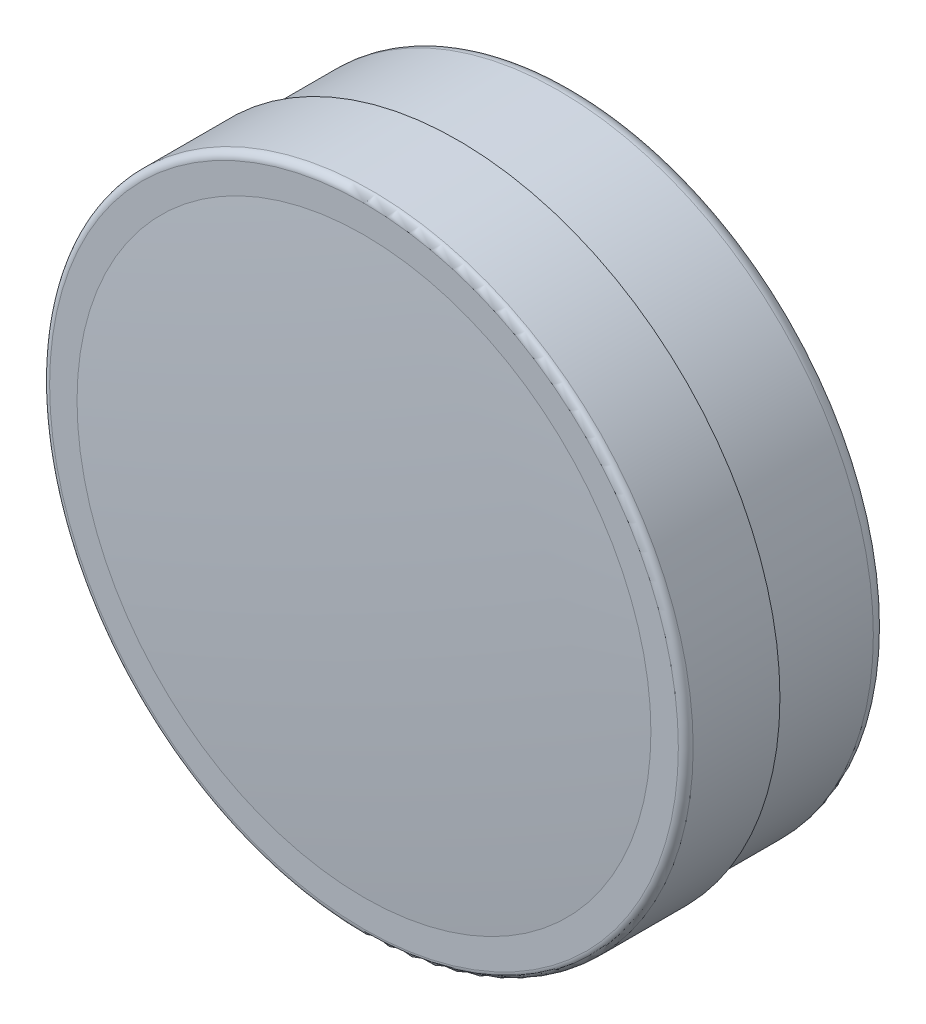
ISO-10303-21;
HEADER;
FILE_DESCRIPTION(('STEP AP214'),'2;1');
FILE_NAME('part.step','',(''),(''),'','','');
FILE_SCHEMA(('AUTOMOTIVE_DESIGN { 1 0 10303 214 1 1 1 1 }'));
ENDSEC;
DATA;
#1=APPLICATION_CONTEXT('core data for automotive mechanical design processes');
#2=APPLICATION_PROTOCOL_DEFINITION('international standard','automotive_design',2000,#1);
#3=PRODUCT_CONTEXT('',#1,'mechanical');
#4=PRODUCT('Part','Part','',(#3));
#5=PRODUCT_RELATED_PRODUCT_CATEGORY('part','',(#4));
#6=PRODUCT_DEFINITION_FORMATION('','',#4);
#7=PRODUCT_DEFINITION_CONTEXT('part definition',#1,'design');
#8=PRODUCT_DEFINITION('design','',#6,#7);
#9=PRODUCT_DEFINITION_SHAPE('','',#8);
#10=(LENGTH_UNIT() NAMED_UNIT(*) SI_UNIT(.MILLI.,.METRE.));
#11=(NAMED_UNIT(*) PLANE_ANGLE_UNIT() SI_UNIT($,.RADIAN.));
#12=(NAMED_UNIT(*) SI_UNIT($,.STERADIAN.) SOLID_ANGLE_UNIT());
#13=UNCERTAINTY_MEASURE_WITH_UNIT(LENGTH_MEASURE(1.E-05),#10,'distance_accuracy_value','');
#14=(GEOMETRIC_REPRESENTATION_CONTEXT(3) GLOBAL_UNCERTAINTY_ASSIGNED_CONTEXT((#13)) GLOBAL_UNIT_ASSIGNED_CONTEXT((#10,
#11,#12)) REPRESENTATION_CONTEXT('',''));
#15=CARTESIAN_POINT('',(0.,0.,0.));
#16=DIRECTION('',(0.,0.,1.));
#17=DIRECTION('',(1.,0.,0.));
#18=AXIS2_PLACEMENT_3D('',#15,#16,#17);
#19=CARTESIAN_POINT('',(-3.,1.73205080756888,-4.2));
#20=DIRECTION('',(0.5,-0.866025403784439,0.));
#21=DIRECTION('',(0.866025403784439,0.5,0.));
#22=AXIS2_PLACEMENT_3D('',#19,#20,#21);
#23=PLANE('',#22);
#24=CARTESIAN_POINT('',(-3.0002,1.73193533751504,-3.93198413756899));
#25=CARTESIAN_POINT('',(-2.86836479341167,1.80805042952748,-3.9759462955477));
#26=CARTESIAN_POINT('',(-2.73539159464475,1.88482254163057,-4.01592841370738));
#27=CARTESIAN_POINT('',(-2.46714257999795,2.03969618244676,-4.08571791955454));
#28=CARTESIAN_POINT('',(-2.33186199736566,2.11780046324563,-4.11550061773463));
#29=CARTESIAN_POINT('',(-2.06297739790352,2.27304105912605,-4.16186216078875));
#30=CARTESIAN_POINT('',(-1.92941475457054,2.35015348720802,-4.17874955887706));
#31=CARTESIAN_POINT('',(-1.66166094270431,2.50474122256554,-4.19891035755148));
#32=CARTESIAN_POINT('',(-1.52747074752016,2.58221596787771,-4.20220045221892));
#33=CARTESIAN_POINT('',(-1.27672440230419,2.72698443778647,-4.19535946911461));
#34=CARTESIAN_POINT('',(-1.16013073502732,2.79429982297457,-4.18690808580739));
#35=CARTESIAN_POINT('',(-0.927703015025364,2.92849202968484,-4.16012105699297));
#36=CARTESIAN_POINT('',(-0.811869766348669,2.99536838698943,-4.1417762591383));
#37=CARTESIAN_POINT('',(-0.578962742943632,3.12983731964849,-4.09591524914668));
#38=CARTESIAN_POINT('',(-0.461918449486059,3.19741287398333,-4.06820461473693));
#39=CARTESIAN_POINT('',(-0.229575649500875,3.33155605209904,-4.00531220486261));
#40=CARTESIAN_POINT('',(-0.114274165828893,3.39812539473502,-3.97014520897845));
#41=CARTESIAN_POINT('',(0.000199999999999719,3.4642170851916,-3.93198413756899));
#42=B_SPLINE_CURVE_WITH_KNOTS('',3,(#24,#25,#26,#27,#28,#29,#30,#31,#32,#33,#34,#35,#36,#37,#38,
#39,#40,#41),.UNSPECIFIED.,.F.,.F.,(4,2,2,2,2,2,2,2,4),(0.,0.475539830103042,0.952222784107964,
1.41710776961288,1.88142182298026,2.28572436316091,2.69040156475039,3.10405572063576,
3.51689749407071),.UNSPECIFIED.);
#43=CARTESIAN_POINT('',(-3.,1.73205080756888,-3.93205080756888));
#44=VERTEX_POINT('',#43);
#45=CARTESIAN_POINT('',(-1.5,2.59807621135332,-4.2));
#46=VERTEX_POINT('',#45);
#47=EDGE_CURVE('E173',#44,#46,#42,.T.);
#48=ORIENTED_EDGE('',*,*,#47,.F.);
#49=DIRECTION('',(0.,0.,1.));
#50=VECTOR('',#49,1.);
#51=CARTESIAN_POINT('',(-3.,1.73205080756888,-4.2));
#52=LINE('',#51,#50);
#53=CARTESIAN_POINT('',(-3.,1.73205080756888,-1.));
#54=VERTEX_POINT('',#53);
#55=EDGE_CURVE('E196',#44,#54,#52,.T.);
#56=ORIENTED_EDGE('',*,*,#55,.T.);
#57=DIRECTION('',(0.866025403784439,0.5,0.));
#58=VECTOR('',#57,1.);
#59=CARTESIAN_POINT('',(-3.,1.73205080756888,-1.));
#60=LINE('',#59,#58);
#61=CARTESIAN_POINT('',(0.,3.46410161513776,-1.));
#62=VERTEX_POINT('',#61);
#63=EDGE_CURVE('E175',#54,#62,#60,.T.);
#64=ORIENTED_EDGE('',*,*,#63,.T.);
#65=DIRECTION('',(0.,0.,1.));
#66=VECTOR('',#65,1.);
#67=CARTESIAN_POINT('',(0.,3.46410161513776,-4.2));
#68=LINE('',#67,#66);
#69=CARTESIAN_POINT('',(0.,3.46410161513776,-3.93205080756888));
#70=VERTEX_POINT('',#69);
#71=EDGE_CURVE('E209',#70,#62,#68,.T.);
#72=ORIENTED_EDGE('',*,*,#71,.F.);
#73=EDGE_CURVE('E166',#46,#70,#42,.T.);
#74=ORIENTED_EDGE('',*,*,#73,.F.);
#75=EDGE_LOOP('',(#48,#56,#64,#72,#74));
#76=FACE_BOUND('',#75,.T.);
#77=ADVANCED_FACE('F15',(#76),#23,.F.);
#78=CARTESIAN_POINT('',(0.,3.46410161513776,-4.2));
#79=DIRECTION('',(-0.5,-0.866025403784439,0.));
#80=DIRECTION('',(0.866025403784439,-0.5,0.));
#81=AXIS2_PLACEMENT_3D('',#78,#79,#80);
#82=PLANE('',#81);
#83=CARTESIAN_POINT('',(-0.000200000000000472,3.4642170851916,-3.93198413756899));
#84=CARTESIAN_POINT('',(0.131635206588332,3.38810199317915,-3.9759462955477));
#85=CARTESIAN_POINT('',(0.264608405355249,3.31132988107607,-4.01592841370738));
#86=CARTESIAN_POINT('',(0.532857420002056,3.15645624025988,-4.08571791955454));
#87=CARTESIAN_POINT('',(0.668138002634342,3.078351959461,-4.11550061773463));
#88=CARTESIAN_POINT('',(0.937022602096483,2.92311136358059,-4.16186216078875));
#89=CARTESIAN_POINT('',(1.07058524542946,2.84599893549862,-4.17874955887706));
#90=CARTESIAN_POINT('',(1.33833905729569,2.6914112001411,-4.19891035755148));
#91=CARTESIAN_POINT('',(1.47252925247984,2.61393645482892,-4.20220045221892));
#92=CARTESIAN_POINT('',(1.72327559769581,2.46916798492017,-4.19535946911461));
#93=CARTESIAN_POINT('',(1.83986926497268,2.40185259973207,-4.18690808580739));
#94=CARTESIAN_POINT('',(2.07229698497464,2.2676603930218,-4.16012105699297));
#95=CARTESIAN_POINT('',(2.18813023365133,2.2007840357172,-4.14177625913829));
#96=CARTESIAN_POINT('',(2.42103725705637,2.06631510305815,-4.09591524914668));
#97=CARTESIAN_POINT('',(2.53808155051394,1.99873954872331,-4.06820461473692));
#98=CARTESIAN_POINT('',(2.77042435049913,1.86459637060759,-4.00531220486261));
#99=CARTESIAN_POINT('',(2.88572583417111,1.79802702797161,-3.97014520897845));
#100=CARTESIAN_POINT('',(3.0002,1.73193533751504,-3.93198413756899));
#101=B_SPLINE_CURVE_WITH_KNOTS('',3,(#83,#84,#85,#86,#87,#88,#89,#90,#91,#92,#93,#94,#95,#96,
#97,#98,#99,#100),.UNSPECIFIED.,.F.,.F.,(4,2,2,2,2,2,2,2,4),(0.,0.475539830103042,
0.952222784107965,1.41710776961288,1.88142182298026,2.28572436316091,2.69040156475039,
3.10405572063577,3.51689749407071),.UNSPECIFIED.);
#102=CARTESIAN_POINT('',(1.5,2.59807621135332,-4.2));
#103=VERTEX_POINT('',#102);
#104=EDGE_CURVE('E174',#70,#103,#101,.T.);
#105=ORIENTED_EDGE('',*,*,#104,.F.);
#106=ORIENTED_EDGE('',*,*,#71,.T.);
#107=DIRECTION('',(0.866025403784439,-0.5,0.));
#108=VECTOR('',#107,1.);
#109=CARTESIAN_POINT('',(0.,3.46410161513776,-1.));
#110=LINE('',#109,#108);
#111=CARTESIAN_POINT('',(3.,1.73205080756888,-1.));
#112=VERTEX_POINT('',#111);
#113=EDGE_CURVE('E179',#62,#112,#110,.T.);
#114=ORIENTED_EDGE('',*,*,#113,.T.);
#115=DIRECTION('',(0.,0.,1.));
#116=VECTOR('',#115,1.);
#117=CARTESIAN_POINT('',(3.,1.73205080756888,-4.2));
#118=LINE('',#117,#116);
#119=CARTESIAN_POINT('',(3.,1.73205080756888,-3.93205080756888));
#120=VERTEX_POINT('',#119);
#121=EDGE_CURVE('E206',#120,#112,#118,.T.);
#122=ORIENTED_EDGE('',*,*,#121,.F.);
#123=EDGE_CURVE('E97',#103,#120,#101,.T.);
#124=ORIENTED_EDGE('',*,*,#123,.F.);
#125=EDGE_LOOP('',(#105,#106,#114,#122,#124));
#126=FACE_BOUND('',#125,.T.);
#127=ADVANCED_FACE('F153',(#126),#82,.F.);
#128=CARTESIAN_POINT('',(3.,1.73205080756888,-4.2));
#129=DIRECTION('',(-1.,0.,0.));
#130=DIRECTION('',(0.,-1.,0.));
#131=AXIS2_PLACEMENT_3D('',#128,#129,#130);
#132=PLANE('',#131);
#133=CARTESIAN_POINT('',(3.,-4.68017607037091,-2.72247928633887));
#134=CARTESIAN_POINT('',(3.,-4.54891485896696,-2.78626352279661));
#135=CARTESIAN_POINT('',(3.,-4.41735529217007,-2.84944414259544));
#136=CARTESIAN_POINT('',(3.,-4.15348089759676,-2.97425922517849));
#137=CARTESIAN_POINT('',(3.,-4.02116595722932,-3.03589344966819));
#138=CARTESIAN_POINT('',(3.,-3.75495369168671,-3.15758101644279));
#139=CARTESIAN_POINT('',(3.,-3.62105168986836,-3.2176241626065));
#140=CARTESIAN_POINT('',(3.,-3.35219236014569,-3.33529012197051));
#141=CARTESIAN_POINT('',(3.,-3.21723508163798,-3.39291304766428));
#142=CARTESIAN_POINT('',(3.,-2.94158230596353,-3.50694906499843));
#143=CARTESIAN_POINT('',(3.,-2.80084422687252,-3.56325978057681));
#144=CARTESIAN_POINT('',(3.,-2.51773172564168,-3.67168603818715));
#145=CARTESIAN_POINT('',(3.,-2.37535712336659,-3.72380111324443));
#146=CARTESIAN_POINT('',(3.,-2.08900278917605,-3.82248819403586));
#147=CARTESIAN_POINT('',(3.,-1.94502688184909,-3.8690711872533));
#148=CARTESIAN_POINT('',(3.,-1.65500976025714,-3.95521756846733));
#149=CARTESIAN_POINT('',(3.,-1.50896920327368,-3.99478313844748));
#150=CARTESIAN_POINT('',(3.,-1.21556004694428,-4.06480103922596));
#151=CARTESIAN_POINT('',(3.,-1.06820376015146,-4.09530402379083));
#152=CARTESIAN_POINT('',(3.,-0.771629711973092,-4.14549397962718));
#153=CARTESIAN_POINT('',(3.,-0.622412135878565,-4.16518201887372));
#154=CARTESIAN_POINT('',(3.,-0.324821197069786,-4.19191487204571));
#155=CARTESIAN_POINT('',(3.,-0.176462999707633,-4.19912435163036));
#156=CARTESIAN_POINT('',(3.,0.120335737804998,-4.2007240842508));
#157=CARTESIAN_POINT('',(3.,0.268776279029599,-4.19511416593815));
#158=CARTESIAN_POINT('',(3.,0.519970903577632,-4.17517336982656));
#159=CARTESIAN_POINT('',(3.,0.622990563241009,-4.1639860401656));
#160=CARTESIAN_POINT('',(3.,0.828291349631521,-4.13611879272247));
#161=CARTESIAN_POINT('',(3.,0.930572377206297,-4.11943815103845));
#162=CARTESIAN_POINT('',(3.,1.23614930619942,-4.06202876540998));
#163=CARTESIAN_POINT('',(3.,1.43806779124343,-4.01394257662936));
#164=CARTESIAN_POINT('',(3.,1.84223302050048,-3.90214893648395));
#165=CARTESIAN_POINT('',(3.,2.04438631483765,-3.83811648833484));
#166=CARTESIAN_POINT('',(3.,2.34480439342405,-3.73419272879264));
#167=CARTESIAN_POINT('',(3.,2.44446577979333,-3.69824274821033));
#168=CARTESIAN_POINT('',(3.,2.64296197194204,-3.62412934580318));
#169=CARTESIAN_POINT('',(3.,2.74179678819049,-3.58596595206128));
#170=CARTESIAN_POINT('',(3.,2.97800396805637,-3.49220828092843));
#171=CARTESIAN_POINT('',(3.,3.1150253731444,-3.43573241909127));
#172=CARTESIAN_POINT('',(3.,3.38787277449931,-3.31995508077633));
#173=CARTESIAN_POINT('',(3.,3.52369869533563,-3.26065342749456));
#174=CARTESIAN_POINT('',(3.,3.79438001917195,-3.13980239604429));
#175=CARTESIAN_POINT('',(3.,3.92923520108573,-3.07825252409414));
#176=CARTESIAN_POINT('',(3.,4.19811392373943,-2.95335951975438));
#177=CARTESIAN_POINT('',(3.,4.33213744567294,-2.89001634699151));
#178=CARTESIAN_POINT('',(3.,4.7334523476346,-2.69769542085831));
#179=CARTESIAN_POINT('',(3.,4.9997060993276,-2.56655399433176));
#180=CARTESIAN_POINT('',(3.,5.53026911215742,-2.3003963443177));
#181=CARTESIAN_POINT('',(3.,5.79457829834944,-2.16537997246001));
#182=CARTESIAN_POINT('',(3.,6.29905617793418,-1.904367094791));
#183=CARTESIAN_POINT('',(3.,6.53934186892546,-1.77859629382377));
#184=CARTESIAN_POINT('',(3.,7.01901948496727,-1.5253424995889));
#185=CARTESIAN_POINT('',(3.,7.25841137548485,-1.39785944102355));
#186=CARTESIAN_POINT('',(3.,7.73587153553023,-1.14192772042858));
#187=CARTESIAN_POINT('',(3.,7.97394162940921,-1.01348245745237));
#188=CARTESIAN_POINT('',(3.,8.44951195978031,-0.755573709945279));
#189=CARTESIAN_POINT('',(3.,8.68701222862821,-0.626110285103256));
#190=CARTESIAN_POINT('',(3.,8.92430377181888,-0.49626819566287));
#191=B_SPLINE_CURVE_WITH_KNOTS('',3,(#133,#134,#135,#136,#137,#138,#139,#140,#141,#142,#143,
#144,#145,#146,#147,#148,#149,#150,#151,#152,#153,#154,#155,#156,#157,#158,#159,#160,#161,#162,
#163,#164,#165,#166,#167,#168,#169,#170,#171,#172,#173,#174,#175,#176,#177,#178,#179,#180,#181,
#182,#183,#184,#185,#186,#187,#188,#189,#190),.UNSPECIFIED.,.F.,.F.,(4,2,2,2,2,2,2,2,2,2,2,2,2,
2,2,2,2,2,2,2,2,2,2,2,2,2,2,2,4),(0.,0.437819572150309,0.875706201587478,1.31593049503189,
1.75613430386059,2.21083849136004,2.66559321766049,3.11942907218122,3.57312356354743,
4.02423232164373,4.4752965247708,4.92036182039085,5.36543306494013,5.67616000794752,
5.98692791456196,6.60879729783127,7.2445600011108,7.56238100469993,7.88019797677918,
8.32476746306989,8.76936480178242,9.21406038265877,9.65876598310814,10.5491056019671,
11.4394793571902,12.2531037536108,13.0667592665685,13.8782859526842,14.6897654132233),.UNSPECIFIED.);
#192=CARTESIAN_POINT('',(3.,0.,-4.2));
#193=VERTEX_POINT('',#192);
#194=EDGE_CURVE('E90',#120,#193,#191,.F.);
#195=ORIENTED_EDGE('',*,*,#194,.F.);
#196=ORIENTED_EDGE('',*,*,#121,.T.);
#197=DIRECTION('',(0.,-1.,0.));
#198=VECTOR('',#197,1.);
#199=CARTESIAN_POINT('',(3.,1.73205080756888,-1.));
#200=LINE('',#199,#198);
#201=CARTESIAN_POINT('',(3.,-1.73205080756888,-1.));
#202=VERTEX_POINT('',#201);
#203=EDGE_CURVE('E183',#112,#202,#200,.T.);
#204=ORIENTED_EDGE('',*,*,#203,.T.);
#205=DIRECTION('',(0.,0.,1.));
#206=VECTOR('',#205,1.);
#207=CARTESIAN_POINT('',(3.,-1.73205080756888,-4.2));
#208=LINE('',#207,#206);
#209=CARTESIAN_POINT('',(3.,-1.73205080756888,-3.93205080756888));
#210=VERTEX_POINT('',#209);
#211=EDGE_CURVE('E122',#210,#202,#208,.T.);
#212=ORIENTED_EDGE('',*,*,#211,.F.);
#213=EDGE_CURVE('E102',#193,#210,#191,.F.);
#214=ORIENTED_EDGE('',*,*,#213,.F.);
#215=EDGE_LOOP('',(#195,#196,#204,#212,#214));
#216=FACE_BOUND('',#215,.T.);
#217=ADVANCED_FACE('F120',(#216),#132,.F.);
#218=CARTESIAN_POINT('',(3.,-1.73205080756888,-4.2));
#219=DIRECTION('',(-0.5,0.866025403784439,0.));
#220=DIRECTION('',(-0.866025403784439,-0.5,0.));
#221=AXIS2_PLACEMENT_3D('',#218,#219,#220);
#222=PLANE('',#221);
#223=CARTESIAN_POINT('',(3.0002,-1.73193533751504,-3.93198413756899));
#224=CARTESIAN_POINT('',(2.86836479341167,-1.80805042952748,-3.9759462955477));
#225=CARTESIAN_POINT('',(2.73539159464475,-1.88482254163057,-4.01592841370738));
#226=CARTESIAN_POINT('',(2.46714257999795,-2.03969618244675,-4.08571791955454));
#227=CARTESIAN_POINT('',(2.33186199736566,-2.11780046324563,-4.11550061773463));
#228=CARTESIAN_POINT('',(2.06297739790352,-2.27304105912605,-4.16186216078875));
#229=CARTESIAN_POINT('',(1.92941475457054,-2.35015348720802,-4.17874955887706));
#230=CARTESIAN_POINT('',(1.66166094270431,-2.50474122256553,-4.19891035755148));
#231=CARTESIAN_POINT('',(1.52747074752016,-2.58221596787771,-4.20220045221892));
#232=CARTESIAN_POINT('',(1.2767244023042,-2.72698443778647,-4.19535946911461));
#233=CARTESIAN_POINT('',(1.16013073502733,-2.79429982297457,-4.18690808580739));
#234=CARTESIAN_POINT('',(0.927703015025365,-2.92849202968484,-4.16012105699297));
#235=CARTESIAN_POINT('',(0.81186976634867,-2.99536838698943,-4.1417762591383));
#236=CARTESIAN_POINT('',(0.578962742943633,-3.12983731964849,-4.09591524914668));
#237=CARTESIAN_POINT('',(0.461918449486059,-3.19741287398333,-4.06820461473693));
#238=CARTESIAN_POINT('',(0.229575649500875,-3.33155605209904,-4.00531220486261));
#239=CARTESIAN_POINT('',(0.114274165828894,-3.39812539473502,-3.97014520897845));
#240=CARTESIAN_POINT('',(-0.000199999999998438,-3.4642170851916,-3.93198413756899));
#241=B_SPLINE_CURVE_WITH_KNOTS('',3,(#223,#224,#225,#226,#227,#228,#229,#230,#231,#232,#233,
#234,#235,#236,#237,#238,#239,#240),.UNSPECIFIED.,.F.,.F.,(4,2,2,2,2,2,2,2,4),(0.,
0.475539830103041,0.952222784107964,1.41710776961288,1.88142182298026,2.28572436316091,
2.69040156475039,3.10405572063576,3.51689749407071),.UNSPECIFIED.);
#242=CARTESIAN_POINT('',(1.5,-2.59807621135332,-4.2));
#243=VERTEX_POINT('',#242);
#244=EDGE_CURVE('E109',#210,#243,#241,.T.);
#245=ORIENTED_EDGE('',*,*,#244,.F.);
#246=ORIENTED_EDGE('',*,*,#211,.T.);
#247=DIRECTION('',(-0.866025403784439,-0.5,0.));
#248=VECTOR('',#247,1.);
#249=CARTESIAN_POINT('',(3.,-1.73205080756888,-1.));
#250=LINE('',#249,#248);
#251=CARTESIAN_POINT('',(0.,-3.46410161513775,-1.));
#252=VERTEX_POINT('',#251);
#253=EDGE_CURVE('E186',#202,#252,#250,.T.);
#254=ORIENTED_EDGE('',*,*,#253,.T.);
#255=DIRECTION('',(0.,0.,1.));
#256=VECTOR('',#255,1.);
#257=CARTESIAN_POINT('',(0.,-3.46410161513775,-4.2));
#258=LINE('',#257,#256);
#259=CARTESIAN_POINT('',(0.,-3.46410161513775,-3.93205080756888));
#260=VERTEX_POINT('',#259);
#261=EDGE_CURVE('E201',#260,#252,#258,.T.);
#262=ORIENTED_EDGE('',*,*,#261,.F.);
#263=EDGE_CURVE('E126',#243,#260,#241,.T.);
#264=ORIENTED_EDGE('',*,*,#263,.F.);
#265=EDGE_LOOP('',(#245,#246,#254,#262,#264));
#266=FACE_BOUND('',#265,.T.);
#267=ADVANCED_FACE('F152',(#266),#222,.F.);
#268=CARTESIAN_POINT('',(0.,-3.46410161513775,-4.2));
#269=DIRECTION('',(0.5,0.866025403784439,0.));
#270=DIRECTION('',(-0.866025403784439,0.5,0.));
#271=AXIS2_PLACEMENT_3D('',#268,#269,#270);
#272=PLANE('',#271);
#273=CARTESIAN_POINT('',(0.000200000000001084,-3.4642170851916,-3.93198413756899));
#274=CARTESIAN_POINT('',(-0.131635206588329,-3.38810199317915,-3.9759462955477));
#275=CARTESIAN_POINT('',(-0.264608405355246,-3.31132988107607,-4.01592841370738));
#276=CARTESIAN_POINT('',(-0.532857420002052,-3.15645624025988,-4.08571791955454));
#277=CARTESIAN_POINT('',(-0.668138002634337,-3.078351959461,-4.11550061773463));
#278=CARTESIAN_POINT('',(-0.937022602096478,-2.92311136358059,-4.16186216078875));
#279=CARTESIAN_POINT('',(-1.07058524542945,-2.84599893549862,-4.17874955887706));
#280=CARTESIAN_POINT('',(-1.33833905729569,-2.6914112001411,-4.19891035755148));
#281=CARTESIAN_POINT('',(-1.47252925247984,-2.61393645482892,-4.20220045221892));
#282=CARTESIAN_POINT('',(-1.7232755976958,-2.46916798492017,-4.19535946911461));
#283=CARTESIAN_POINT('',(-1.83986926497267,-2.40185259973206,-4.18690808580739));
#284=CARTESIAN_POINT('',(-2.07229698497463,-2.2676603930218,-4.16012105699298));
#285=CARTESIAN_POINT('',(-2.18813023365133,-2.2007840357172,-4.1417762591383));
#286=CARTESIAN_POINT('',(-2.42103725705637,-2.06631510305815,-4.09591524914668));
#287=CARTESIAN_POINT('',(-2.53808155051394,-1.99873954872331,-4.06820461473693));
#288=CARTESIAN_POINT('',(-2.77042435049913,-1.86459637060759,-4.00531220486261));
#289=CARTESIAN_POINT('',(-2.88572583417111,-1.79802702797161,-3.97014520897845));
#290=CARTESIAN_POINT('',(-3.0002,-1.73193533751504,-3.93198413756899));
#291=B_SPLINE_CURVE_WITH_KNOTS('',3,(#273,#274,#275,#276,#277,#278,#279,#280,#281,#282,#283,
#284,#285,#286,#287,#288,#289,#290),.UNSPECIFIED.,.F.,.F.,(4,2,2,2,2,2,2,2,4),(0.,
0.475539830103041,0.952222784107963,1.41710776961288,1.88142182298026,2.28572436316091,
2.69040156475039,3.10405572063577,3.51689749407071),.UNSPECIFIED.);
#292=CARTESIAN_POINT('',(-1.5,-2.59807621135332,-4.2));
#293=VERTEX_POINT('',#292);
#294=EDGE_CURVE('E264',#260,#293,#291,.T.);
#295=ORIENTED_EDGE('',*,*,#294,.F.);
#296=ORIENTED_EDGE('',*,*,#261,.T.);
#297=DIRECTION('',(-0.866025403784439,0.5,0.));
#298=VECTOR('',#297,1.);
#299=CARTESIAN_POINT('',(0.,-3.46410161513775,-1.));
#300=LINE('',#299,#298);
#301=CARTESIAN_POINT('',(-3.,-1.73205080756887,-1.));
#302=VERTEX_POINT('',#301);
#303=EDGE_CURVE('E190',#252,#302,#300,.T.);
#304=ORIENTED_EDGE('',*,*,#303,.T.);
#305=DIRECTION('',(0.,0.,1.));
#306=VECTOR('',#305,1.);
#307=CARTESIAN_POINT('',(-3.,-1.73205080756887,-4.2));
#308=LINE('',#307,#306);
#309=CARTESIAN_POINT('',(-3.,-1.73205080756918,-3.93205080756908));
#310=VERTEX_POINT('',#309);
#311=EDGE_CURVE('E38',#310,#302,#308,.T.);
#312=ORIENTED_EDGE('',*,*,#311,.F.);
#313=EDGE_CURVE('E262',#293,#310,#291,.T.);
#314=ORIENTED_EDGE('',*,*,#313,.F.);
#315=EDGE_LOOP('',(#295,#296,#304,#312,#314));
#316=FACE_BOUND('',#315,.T.);
#317=ADVANCED_FACE('F263',(#316),#272,.F.);
#318=CARTESIAN_POINT('',(-3.,-1.73205080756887,-4.2));
#319=DIRECTION('',(1.,0.,0.));
#320=DIRECTION('',(0.,0.,-1.));
#321=AXIS2_PLACEMENT_3D('',#318,#319,#320);
#322=PLANE('',#321);
#323=CARTESIAN_POINT('',(-3.,-4.68017606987,-2.72247928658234));
#324=CARTESIAN_POINT('',(-3.,-4.54891485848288,-2.78626352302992));
#325=CARTESIAN_POINT('',(-3.,-4.41735529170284,-2.84944414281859));
#326=CARTESIAN_POINT('',(-3.,-4.15348089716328,-2.97425922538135));
#327=CARTESIAN_POINT('',(-3.,-4.02116595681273,-3.03589344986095));
#328=CARTESIAN_POINT('',(-3.,-3.75495369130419,-3.15758101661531));
#329=CARTESIAN_POINT('',(-3.,-3.621051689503,-3.2176241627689));
#330=CARTESIAN_POINT('',(-3.,-3.35219235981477,-3.33529012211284));
#331=CARTESIAN_POINT('',(-3.,-3.21723508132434,-3.39291304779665));
#332=CARTESIAN_POINT('',(-3.,-2.94158230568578,-3.50694906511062));
#333=CARTESIAN_POINT('',(-3.,-2.80084422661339,-3.56325978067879));
#334=CARTESIAN_POINT('',(-3.,-2.51773172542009,-3.67168603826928));
#335=CARTESIAN_POINT('',(-3.,-2.37535712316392,-3.72380111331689));
#336=CARTESIAN_POINT('',(-3.,-2.08900278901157,-3.82248819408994));
#337=CARTESIAN_POINT('',(-3.,-1.94502688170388,-3.86907118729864));
#338=CARTESIAN_POINT('',(-3.,-1.655009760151,-3.95521756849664));
#339=CARTESIAN_POINT('',(-3.,-1.50896920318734,-3.9947831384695));
#340=CARTESIAN_POINT('',(-3.,-1.21556004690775,-4.06480103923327));
#341=CARTESIAN_POINT('',(-3.,-1.06820376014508,-4.09530402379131));
#342=CARTESIAN_POINT('',(-3.,-0.771629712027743,-4.14549397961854));
#343=CARTESIAN_POINT('',(-3.,-0.622412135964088,-4.16518201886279));
#344=CARTESIAN_POINT('',(-3.,-0.324821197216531,-4.19191487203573));
#345=CARTESIAN_POINT('',(-3.,-0.176462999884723,-4.19912435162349));
#346=CARTESIAN_POINT('',(-3.,0.120335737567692,-4.20072408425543));
#347=CARTESIAN_POINT('',(-3.,0.268776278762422,-4.19511416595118));
#348=CARTESIAN_POINT('',(-3.,0.519970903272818,-4.1751733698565));
#349=CARTESIAN_POINT('',(-3.,0.622990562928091,-4.16398604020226));
#350=CARTESIAN_POINT('',(-3.,0.828291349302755,-4.13611879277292));
#351=CARTESIAN_POINT('',(-3.,0.930572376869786,-4.11943815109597));
#352=CARTESIAN_POINT('',(-3.,1.23614930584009,-4.06202876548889));
#353=CARTESIAN_POINT('',(-3.,1.43806779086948,-4.01394257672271));
#354=CARTESIAN_POINT('',(-3.,1.84223302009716,-3.90214893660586));
#355=CARTESIAN_POINT('',(-3.,2.04438631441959,-3.83811648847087));
#356=CARTESIAN_POINT('',(-3.,2.344804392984,-3.73419272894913));
#357=CARTESIAN_POINT('',(-3.,2.44446577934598,-3.69824274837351));
#358=CARTESIAN_POINT('',(-3.,2.64296197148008,-3.62412934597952));
#359=CARTESIAN_POINT('',(-3.,2.74179678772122,-3.58596595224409));
#360=CARTESIAN_POINT('',(-3.,2.97800396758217,-3.49220828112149));
#361=CARTESIAN_POINT('',(-3.,3.11502537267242,-3.43573241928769));
#362=CARTESIAN_POINT('',(-3.,3.38787277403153,-3.31995508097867));
#363=CARTESIAN_POINT('',(-3.,3.52369869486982,-3.26065342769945));
#364=CARTESIAN_POINT('',(-3.,3.79438001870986,-3.13980239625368));
#365=CARTESIAN_POINT('',(-3.,3.9292352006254,-3.07825252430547));
#366=CARTESIAN_POINT('',(-3.,4.19811392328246,-2.95335951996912));
#367=CARTESIAN_POINT('',(-3.,4.33213744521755,-2.89001634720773));
#368=CARTESIAN_POINT('',(-3.,4.73345234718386,-2.69769542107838));
#369=CARTESIAN_POINT('',(-3.,4.99970609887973,-2.56655399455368));
#370=CARTESIAN_POINT('',(-3.,5.53026911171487,-2.30039634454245));
#371=CARTESIAN_POINT('',(-3.,5.79457829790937,-2.16537997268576));
#372=CARTESIAN_POINT('',(-3.,6.2990561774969,-1.90436709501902));
#373=CARTESIAN_POINT('',(-3.,6.53934186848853,-1.77859629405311));
#374=CARTESIAN_POINT('',(-3.,7.0190194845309,-1.52534249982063));
#375=CARTESIAN_POINT('',(-3.,7.25841137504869,-1.39785944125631));
#376=CARTESIAN_POINT('',(-3.,7.73587153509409,-1.14192772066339));
#377=CARTESIAN_POINT('',(-3.,7.97394162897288,-1.01348245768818));
#378=CARTESIAN_POINT('',(-3.,8.44951195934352,-0.755573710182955));
#379=CARTESIAN_POINT('',(-3.,8.68701222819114,-0.626110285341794));
#380=CARTESIAN_POINT('',(-3.,8.92430377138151,-0.496268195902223));
#381=B_SPLINE_CURVE_WITH_KNOTS('',3,(#323,#324,#325,#326,#327,#328,#329,#330,#331,#332,#333,
#334,#335,#336,#337,#338,#339,#340,#341,#342,#343,#344,#345,#346,#347,#348,#349,#350,#351,#352,
#353,#354,#355,#356,#357,#358,#359,#360,#361,#362,#363,#364,#365,#366,#367,#368,#369,#370,#371,
#372,#373,#374,#375,#376,#377,#378,#379,#380),.UNSPECIFIED.,.F.,.F.,(4,2,2,2,2,2,2,2,2,2,2,2,2,
2,2,2,2,2,2,2,2,2,2,2,2,2,2,2,4),(0.,0.43781957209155,0.875706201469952,1.31593049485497,
1.75613430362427,2.21083849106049,2.66559321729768,3.11942907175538,3.5731235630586,
4.02423232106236,4.47529652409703,4.92036181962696,5.36543306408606,5.67616000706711,
5.9869279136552,6.60879729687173,7.24456000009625,7.56238100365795,7.88019797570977,
8.32476746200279,8.76936480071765,9.21406038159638,9.65876598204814,10.5491056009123,
11.4394793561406,12.2531037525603,13.0667592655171,13.8782859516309,14.689765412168),.UNSPECIFIED.);
#382=CARTESIAN_POINT('',(-3.,0.,-4.2));
#383=VERTEX_POINT('',#382);
#384=EDGE_CURVE('E268',#310,#383,#381,.T.);
#385=ORIENTED_EDGE('',*,*,#384,.F.);
#386=ORIENTED_EDGE('',*,*,#311,.T.);
#387=DIRECTION('',(0.,1.,0.));
#388=VECTOR('',#387,1.);
#389=CARTESIAN_POINT('',(-3.,-1.73205080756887,-1.));
#390=LINE('',#389,#388);
#391=EDGE_CURVE('E193',#302,#54,#390,.T.);
#392=ORIENTED_EDGE('',*,*,#391,.T.);
#393=ORIENTED_EDGE('',*,*,#55,.F.);
#394=EDGE_CURVE('E117',#383,#44,#381,.T.);
#395=ORIENTED_EDGE('',*,*,#394,.F.);
#396=EDGE_LOOP('',(#385,#386,#392,#393,#395));
#397=FACE_BOUND('',#396,.T.);
#398=ADVANCED_FACE('F283',(#397),#322,.F.);
#399=CARTESIAN_POINT('',(5.35,0.,-1.));
#400=DIRECTION('',(0.,0.,-1.));
#401=DIRECTION('',(-1.,0.,0.));
#402=AXIS2_PLACEMENT_3D('',#399,#400,#401);
#403=PLANE('',#402);
#404=CARTESIAN_POINT('',(0.,0.,-1.));
#405=DIRECTION('',(0.,0.,1.));
#406=DIRECTION('',(1.,0.,0.));
#407=AXIS2_PLACEMENT_3D('',#404,#405,#406);
#408=CIRCLE('',#407,5.35);
#409=CARTESIAN_POINT('',(5.35,0.,-1.));
#410=VERTEX_POINT('',#409);
#411=EDGE_CURVE('E212',#410,#410,#408,.T.);
#412=ORIENTED_EDGE('',*,*,#411,.F.);
#413=EDGE_LOOP('',(#412));
#414=FACE_BOUND('',#413,.T.);
#415=ORIENTED_EDGE('',*,*,#113,.F.);
#416=ORIENTED_EDGE('',*,*,#63,.F.);
#417=ORIENTED_EDGE('',*,*,#391,.F.);
#418=ORIENTED_EDGE('',*,*,#303,.F.);
#419=ORIENTED_EDGE('',*,*,#253,.F.);
#420=ORIENTED_EDGE('',*,*,#203,.F.);
#421=EDGE_LOOP('',(#415,#416,#417,#418,#419,#420));
#422=FACE_BOUND('',#421,.T.);
#423=ADVANCED_FACE('F164',(#414,#422),#403,.T.);
#424=CARTESIAN_POINT('',(0.,0.,-470.2));
#425=DIRECTION('',(0.,0.,1.));
#426=DIRECTION('',(-1.,0.,0.));
#427=AXIS2_PLACEMENT_3D('',#424,#425,#426);
#428=SPHERICAL_SURFACE('',#427,500.);
#429=CARTESIAN_POINT('',(0.,0.,28.3));
#430=DIRECTION('',(0.,0.,1.));
#431=DIRECTION('',(1.,0.,0.));
#432=AXIS2_PLACEMENT_3D('',#429,#430,#431);
#433=CIRCLE('',#432,38.7007751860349);
#434=CARTESIAN_POINT('',(38.7007751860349,0.,28.3));
#435=VERTEX_POINT('',#434);
#436=EDGE_CURVE('E244',#435,#435,#433,.T.);
#437=ORIENTED_EDGE('',*,*,#436,.T.);
#438=EDGE_LOOP('',(#437));
#439=FACE_BOUND('',#438,.T.);
#440=ADVANCED_FACE('F309',(#439),#428,.T.);
#441=CARTESIAN_POINT('',(42.4,0.,28.3));
#442=DIRECTION('',(0.,0.,1.));
#443=DIRECTION('',(1.,0.,0.));
#444=AXIS2_PLACEMENT_3D('',#441,#442,#443);
#445=PLANE('',#444);
#446=CARTESIAN_POINT('',(0.,0.,28.3));
#447=DIRECTION('',(0.,0.,1.));
#448=DIRECTION('',(1.,0.,0.));
#449=AXIS2_PLACEMENT_3D('',#446,#447,#448);
#450=CIRCLE('',#449,42.4);
#451=CARTESIAN_POINT('',(42.4,0.,28.3));
#452=VERTEX_POINT('',#451);
#453=EDGE_CURVE('E240',#452,#452,#450,.T.);
#454=ORIENTED_EDGE('',*,*,#453,.T.);
#455=EDGE_LOOP('',(#454));
#456=FACE_BOUND('',#455,.T.);
#457=ORIENTED_EDGE('',*,*,#436,.F.);
#458=EDGE_LOOP('',(#457));
#459=FACE_BOUND('',#458,.T.);
#460=ADVANCED_FACE('F312',(#456,#459),#445,.T.);
#461=CARTESIAN_POINT('',(0.,0.,27.3));
#462=DIRECTION('',(0.,0.,1.));
#463=DIRECTION('',(1.,0.,0.));
#464=AXIS2_PLACEMENT_3D('',#461,#462,#463);
#465=TOROIDAL_SURFACE('',#464,42.4,1.);
#466=CARTESIAN_POINT('',(0.,0.,27.3));
#467=DIRECTION('',(0.,0.,1.));
#468=DIRECTION('',(1.,0.,0.));
#469=AXIS2_PLACEMENT_3D('',#466,#467,#468);
#470=CIRCLE('',#469,43.4);
#471=CARTESIAN_POINT('',(43.4,0.,27.3));
#472=VERTEX_POINT('',#471);
#473=EDGE_CURVE('E236',#472,#472,#470,.T.);
#474=ORIENTED_EDGE('',*,*,#473,.T.);
#475=EDGE_LOOP('',(#474));
#476=FACE_BOUND('',#475,.T.);
#477=ORIENTED_EDGE('',*,*,#453,.F.);
#478=EDGE_LOOP('',(#477));
#479=FACE_BOUND('',#478,.T.);
#480=ADVANCED_FACE('F316',(#476,#479),#465,.T.);
#481=CARTESIAN_POINT('',(0.,0.,36.1));
#482=DIRECTION('',(0.,0.,1.));
#483=DIRECTION('',(1.,0.,0.));
#484=AXIS2_PLACEMENT_3D('',#481,#482,#483);
#485=CYLINDRICAL_SURFACE('',#484,43.4);
#486=CARTESIAN_POINT('',(0.,0.,15.6));
#487=DIRECTION('',(0.,0.,1.));
#488=DIRECTION('',(1.,0.,0.));
#489=AXIS2_PLACEMENT_3D('',#486,#487,#488);
#490=CIRCLE('',#489,43.4);
#491=CARTESIAN_POINT('',(43.4,0.,15.6));
#492=VERTEX_POINT('',#491);
#493=EDGE_CURVE('E232',#492,#492,#490,.T.);
#494=ORIENTED_EDGE('',*,*,#493,.T.);
#495=EDGE_LOOP('',(#494));
#496=FACE_BOUND('',#495,.T.);
#497=ORIENTED_EDGE('',*,*,#473,.F.);
#498=EDGE_LOOP('',(#497));
#499=FACE_BOUND('',#498,.T.);
#500=ADVANCED_FACE('F320',(#496,#499),#485,.T.);
#501=CARTESIAN_POINT('',(42.4,0.,15.6));
#502=DIRECTION('',(0.,0.,-1.));
#503=DIRECTION('',(-1.,0.,0.));
#504=AXIS2_PLACEMENT_3D('',#501,#502,#503);
#505=PLANE('',#504);
#506=CARTESIAN_POINT('',(0.,0.,15.6));
#507=DIRECTION('',(0.,0.,1.));
#508=DIRECTION('',(1.,0.,0.));
#509=AXIS2_PLACEMENT_3D('',#506,#507,#508);
#510=CIRCLE('',#509,42.4);
#511=CARTESIAN_POINT('',(42.4,0.,15.6));
#512=VERTEX_POINT('',#511);
#513=EDGE_CURVE('E228',#512,#512,#510,.T.);
#514=ORIENTED_EDGE('',*,*,#513,.T.);
#515=EDGE_LOOP('',(#514));
#516=FACE_BOUND('',#515,.T.);
#517=ORIENTED_EDGE('',*,*,#493,.F.);
#518=EDGE_LOOP('',(#517));
#519=FACE_BOUND('',#518,.T.);
#520=ADVANCED_FACE('F324',(#516,#519),#505,.T.);
#521=CARTESIAN_POINT('',(0.,0.,36.1));
#522=DIRECTION('',(0.,0.,1.));
#523=DIRECTION('',(1.,0.,0.));
#524=AXIS2_PLACEMENT_3D('',#521,#522,#523);
#525=CYLINDRICAL_SURFACE('',#524,42.4);
#526=CARTESIAN_POINT('',(0.,0.,2.));
#527=DIRECTION('',(0.,0.,1.));
#528=DIRECTION('',(1.,0.,0.));
#529=AXIS2_PLACEMENT_3D('',#526,#527,#528);
#530=CIRCLE('',#529,42.4);
#531=CARTESIAN_POINT('',(42.4,0.,2.));
#532=VERTEX_POINT('',#531);
#533=EDGE_CURVE('E224',#532,#532,#530,.T.);
#534=ORIENTED_EDGE('',*,*,#533,.T.);
#535=EDGE_LOOP('',(#534));
#536=FACE_BOUND('',#535,.T.);
#537=ORIENTED_EDGE('',*,*,#513,.F.);
#538=EDGE_LOOP('',(#537));
#539=FACE_BOUND('',#538,.T.);
#540=ADVANCED_FACE('F328',(#536,#539),#525,.T.);
#541=CARTESIAN_POINT('',(0.,0.,2.));
#542=DIRECTION('',(0.,0.,1.));
#543=DIRECTION('',(1.,0.,0.));
#544=AXIS2_PLACEMENT_3D('',#541,#542,#543);
#545=TOROIDAL_SURFACE('',#544,40.4,2.);
#546=CARTESIAN_POINT('',(0.,0.,0.));
#547=DIRECTION('',(0.,0.,1.));
#548=DIRECTION('',(1.,0.,0.));
#549=AXIS2_PLACEMENT_3D('',#546,#547,#548);
#550=CIRCLE('',#549,40.4);
#551=CARTESIAN_POINT('',(40.4,0.,0.));
#552=VERTEX_POINT('',#551);
#553=EDGE_CURVE('E220',#552,#552,#550,.T.);
#554=ORIENTED_EDGE('',*,*,#553,.T.);
#555=EDGE_LOOP('',(#554));
#556=FACE_BOUND('',#555,.T.);
#557=ORIENTED_EDGE('',*,*,#533,.F.);
#558=EDGE_LOOP('',(#557));
#559=FACE_BOUND('',#558,.T.);
#560=ADVANCED_FACE('F332',(#556,#559),#545,.T.);
#561=CARTESIAN_POINT('',(40.4,0.,0.));
#562=DIRECTION('',(0.,0.,-1.));
#563=DIRECTION('',(-1.,0.,0.));
#564=AXIS2_PLACEMENT_3D('',#561,#562,#563);
#565=PLANE('',#564);
#566=CARTESIAN_POINT('',(0.,0.,0.));
#567=DIRECTION('',(0.,0.,1.));
#568=DIRECTION('',(1.,0.,0.));
#569=AXIS2_PLACEMENT_3D('',#566,#567,#568);
#570=CIRCLE('',#569,5.35);
#571=CARTESIAN_POINT('',(5.35,0.,0.));
#572=VERTEX_POINT('',#571);
#573=EDGE_CURVE('E216',#572,#572,#570,.T.);
#574=ORIENTED_EDGE('',*,*,#573,.T.);
#575=EDGE_LOOP('',(#574));
#576=FACE_BOUND('',#575,.T.);
#577=ORIENTED_EDGE('',*,*,#553,.F.);
#578=EDGE_LOOP('',(#577));
#579=FACE_BOUND('',#578,.T.);
#580=ADVANCED_FACE('F336',(#576,#579),#565,.T.);
#581=CARTESIAN_POINT('',(0.,0.,36.1));
#582=DIRECTION('',(0.,0.,1.));
#583=DIRECTION('',(1.,0.,0.));
#584=AXIS2_PLACEMENT_3D('',#581,#582,#583);
#585=CYLINDRICAL_SURFACE('',#584,5.35);
#586=ORIENTED_EDGE('',*,*,#411,.T.);
#587=EDGE_LOOP('',(#586));
#588=FACE_BOUND('',#587,.T.);
#589=ORIENTED_EDGE('',*,*,#573,.F.);
#590=EDGE_LOOP('',(#589));
#591=FACE_BOUND('',#590,.T.);
#592=ADVANCED_FACE('F339',(#588,#591),#585,.T.);
#593=CARTESIAN_POINT('',(0.,0.,-3.31227731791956));
#594=DIRECTION('',(0.,0.,1.));
#595=DIRECTION('',(1.,0.,0.));
#596=AXIS2_PLACEMENT_3D('',#593,#594,#595);
#597=CONICAL_SURFACE('',#596,4.53758078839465,1.0471975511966);
#598=ORIENTED_EDGE('',*,*,#313,.T.);
#599=ORIENTED_EDGE('',*,*,#384,.T.);
#600=CARTESIAN_POINT('',(0.,0.,-4.2));
#601=DIRECTION('',(0.,0.,-1.));
#602=DIRECTION('',(-1.,0.,0.));
#603=AXIS2_PLACEMENT_3D('',#600,#601,#602);
#604=CIRCLE('',#603,3.);
#605=EDGE_CURVE('E19',#293,#383,#604,.T.);
#606=ORIENTED_EDGE('',*,*,#605,.F.);
#607=EDGE_LOOP('',(#598,#599,#606));
#608=FACE_BOUND('',#607,.T.);
#609=ADVANCED_FACE('F307',(#608),#597,.T.);
#610=ORIENTED_EDGE('',*,*,#263,.T.);
#611=ORIENTED_EDGE('',*,*,#294,.T.);
#612=EDGE_CURVE('E113',#243,#293,#604,.T.);
#613=ORIENTED_EDGE('',*,*,#612,.F.);
#614=EDGE_LOOP('',(#610,#611,#613));
#615=FACE_BOUND('',#614,.T.);
#616=ADVANCED_FACE('F347',(#615),#597,.T.);
#617=ORIENTED_EDGE('',*,*,#213,.T.);
#618=ORIENTED_EDGE('',*,*,#244,.T.);
#619=EDGE_CURVE('E106',#193,#243,#604,.T.);
#620=ORIENTED_EDGE('',*,*,#619,.F.);
#621=EDGE_LOOP('',(#617,#618,#620));
#622=FACE_BOUND('',#621,.T.);
#623=ADVANCED_FACE('F107',(#622),#597,.T.);
#624=ORIENTED_EDGE('',*,*,#123,.T.);
#625=ORIENTED_EDGE('',*,*,#194,.T.);
#626=CARTESIAN_POINT('',(0.,0.,-4.2));
#627=DIRECTION('',(0.,0.,1.));
#628=DIRECTION('',(1.,0.,0.));
#629=AXIS2_PLACEMENT_3D('',#626,#627,#628);
#630=CIRCLE('',#629,3.);
#631=EDGE_CURVE('E94',#193,#103,#630,.T.);
#632=ORIENTED_EDGE('',*,*,#631,.T.);
#633=EDGE_LOOP('',(#624,#625,#632));
#634=FACE_BOUND('',#633,.T.);
#635=ADVANCED_FACE('F92',(#634),#597,.T.);
#636=ORIENTED_EDGE('',*,*,#73,.T.);
#637=ORIENTED_EDGE('',*,*,#104,.T.);
#638=EDGE_CURVE('E25',#46,#103,#604,.T.);
#639=ORIENTED_EDGE('',*,*,#638,.F.);
#640=EDGE_LOOP('',(#636,#637,#639));
#641=FACE_BOUND('',#640,.T.);
#642=ADVANCED_FACE('F305',(#641),#597,.T.);
#643=ORIENTED_EDGE('',*,*,#47,.T.);
#644=EDGE_CURVE('E9',#383,#46,#604,.T.);
#645=ORIENTED_EDGE('',*,*,#644,.F.);
#646=ORIENTED_EDGE('',*,*,#394,.T.);
#647=EDGE_LOOP('',(#643,#645,#646));
#648=FACE_BOUND('',#647,.T.);
#649=ADVANCED_FACE('F147',(#648),#597,.T.);
#650=CARTESIAN_POINT('',(7.49400541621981E-13,0.,-2.04791666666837));
#651=DIRECTION('',(0.,0.,1.));
#652=DIRECTION('',(1.,0.,0.));
#653=AXIS2_PLACEMENT_3D('',#650,#651,#652);
#654=SPHERICAL_SURFACE('',#653,2.85208333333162);
#655=CARTESIAN_POINT('',(0.,0.,-4.29999999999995));
#656=DIRECTION('',(0.,0.,1.));
#657=DIRECTION('',(1.,0.,0.));
#658=AXIS2_PLACEMENT_3D('',#655,#656,#657);
#659=CIRCLE('',#658,1.75000000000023);
#660=CARTESIAN_POINT('',(1.75000000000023,0.,-4.29999999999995));
#661=VERTEX_POINT('',#660);
#662=EDGE_CURVE('E248',#661,#661,#659,.T.);
#663=ORIENTED_EDGE('',*,*,#662,.F.);
#664=EDGE_LOOP('',(#663));
#665=FACE_BOUND('',#664,.T.);
#666=ADVANCED_FACE('F292',(#665),#654,.T.);
#667=CARTESIAN_POINT('',(0.,0.,36.1));
#668=DIRECTION('',(0.,0.,1.));
#669=DIRECTION('',(1.,0.,0.));
#670=AXIS2_PLACEMENT_3D('',#667,#668,#669);
#671=CYLINDRICAL_SURFACE('',#670,1.74999999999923);
#672=CARTESIAN_POINT('',(0.,0.,-4.2));
#673=DIRECTION('',(0.,0.,-1.));
#674=DIRECTION('',(-1.,0.,0.));
#675=AXIS2_PLACEMENT_3D('',#672,#673,#674);
#676=CIRCLE('',#675,1.74999999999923);
#677=CARTESIAN_POINT('',(-1.74999999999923,0.,-4.2));
#678=VERTEX_POINT('',#677);
#679=EDGE_CURVE('E251',#678,#678,#676,.F.);
#680=ORIENTED_EDGE('',*,*,#679,.F.);
#681=EDGE_LOOP('',(#680));
#682=FACE_BOUND('',#681,.T.);
#683=ORIENTED_EDGE('',*,*,#662,.T.);
#684=EDGE_LOOP('',(#683));
#685=FACE_BOUND('',#684,.T.);
#686=ADVANCED_FACE('F17',(#682,#685),#671,.T.);
#687=CARTESIAN_POINT('',(0.,3.46410161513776,-4.2));
#688=DIRECTION('',(0.,0.,-1.));
#689=DIRECTION('',(-1.,0.,0.));
#690=AXIS2_PLACEMENT_3D('',#687,#688,#689);
#691=PLANE('',#690);
#692=ORIENTED_EDGE('',*,*,#679,.T.);
#693=EDGE_LOOP('',(#692));
#694=FACE_BOUND('',#693,.T.);
#695=ORIENTED_EDGE('',*,*,#605,.T.);
#696=ORIENTED_EDGE('',*,*,#644,.T.);
#697=ORIENTED_EDGE('',*,*,#638,.T.);
#698=ORIENTED_EDGE('',*,*,#631,.F.);
#699=ORIENTED_EDGE('',*,*,#619,.T.);
#700=ORIENTED_EDGE('',*,*,#612,.T.);
#701=EDGE_LOOP('',(#695,#696,#697,#698,#699,#700));
#702=FACE_BOUND('',#701,.T.);
#703=ADVANCED_FACE('F114',(#694,#702),#691,.T.);
#704=CLOSED_SHELL('',(#77,#127,#217,#267,#317,#398,#423,#440,#460,#480,#500,#520,#540,#560,#580,
#592,#609,#616,#623,#635,#642,#649,#666,#686,#703));
#705=MANIFOLD_SOLID_BREP('B1',#704);
#706=ADVANCED_BREP_SHAPE_REPRESENTATION('',(#18,#705),#14);
#707=SHAPE_DEFINITION_REPRESENTATION(#9,#706);
ENDSEC;
END-ISO-10303-21;
